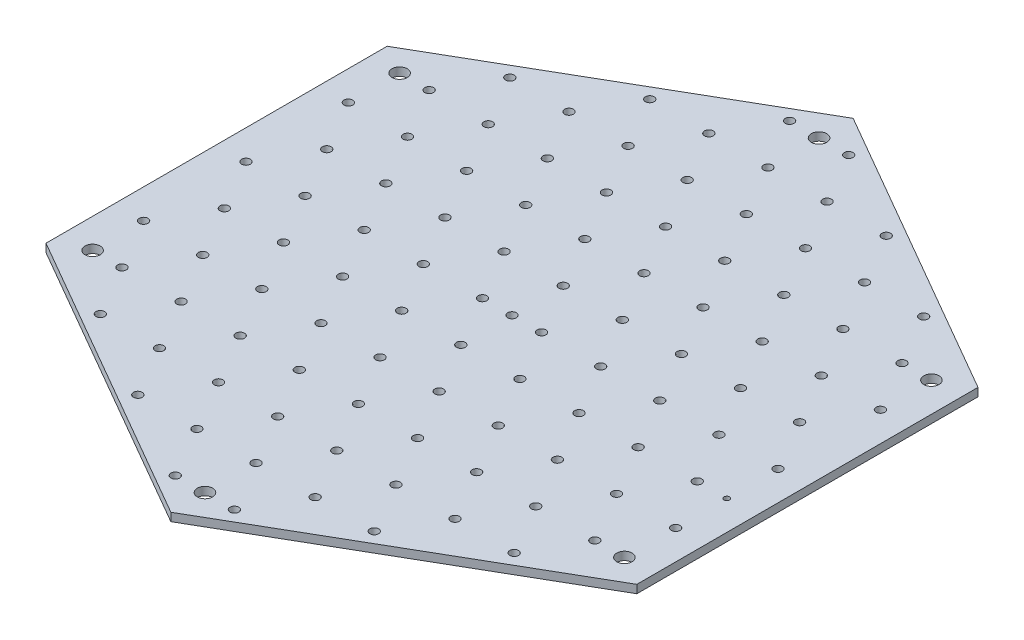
from build123d import *

# Parameters (mm, degrees)
BOSS_EXTRUDE1_DEPTH  = 1.5
SKETCH4_R            = 1.4
CUT_EXTRUDE3_DEPTH   = 83.693334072
LPATTERN4_COUNT      = 6
LPATTERN4_PITCH      = 10.83
LPATTERN4_COL_COUNT  = 5
LPATTERN4_COL_PITCH  = 10.83
LPATTERN5_COUNT      = 6
LPATTERN5_PITCH      = 10.83
LPATTERN5_COL_COUNT  = 5
LPATTERN5_COL_PITCH  = 10.83
LPATTERN6_COUNT      = 7
LPATTERN6_PITCH      = 10.83
LPATTERN6_COL_COUNT  = 4
LPATTERN6_COL_PITCH  = 10.83
LPATTERN7_COUNT      = 7
LPATTERN7_PITCH      = 10.83
LPATTERN7_COL_COUNT  = 3
LPATTERN7_COL_PITCH  = 10.83
LPATTERN8_COUNT      = 6
LPATTERN8_PITCH      = 10.83
LPATTERN9_COUNT      = 6
LPATTERN9_PITCH      = 10.83
LPATTERN10_COUNT     = 7
LPATTERN10_PITCH     = 10.83
LPATTERN10_COL_COUNT = 3
LPATTERN10_COL_PITCH = 10.83
LPATTERN11_COUNT     = 7
LPATTERN11_PITCH     = 10.83
LPATTERN11_COL_COUNT = 4
LPATTERN11_COL_PITCH = 10.83
LPATTERN12_COUNT     = 5
LPATTERN12_PITCH     = 10.83
LPATTERN12_COL_COUNT = 6
LPATTERN12_COL_PITCH = 10.83
LPATTERN13_COUNT     = 5
LPATTERN13_PITCH     = 10.83
LPATTERN13_COL_COUNT = 6
LPATTERN13_COL_PITCH = 10.83
LPATTERN14_COUNT     = 5
LPATTERN14_PITCH     = 10.83
LPATTERN15_COUNT     = 4
LPATTERN15_PITCH     = 10.83
LPATTERN16_COUNT     = 3
LPATTERN16_PITCH     = 10.83
LPATTERN17_COUNT     = 5
LPATTERN17_PITCH     = 10.83
LPATTERN18_COUNT     = 4
LPATTERN18_PITCH     = 10.83
LPATTERN19_COUNT     = 3
LPATTERN19_PITCH     = 10.83
SKETCH16_R           = 0.5
CUT_EXTRUDE4_DEPTH   = 83.693334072


with BuildPart() as part:
    # Sketch1 → Boss-Extrude1 (new body)
    with BuildSketch(Plane(origin=(0, 0, 0), x_dir=(1, 0, 0), z_dir=(0, 1, 0))):
        Polygon((0, 62.5), (-54.126587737, 31.25), (-54.126587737, -31.25), (0, -62.5), (54.126587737, -31.25), (54.126587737, 31.25), align=None)
    extrude(amount=BOSS_EXTRUDE1_DEPTH)

    # Sketch4 → Cut-Extrude3 (cut, through all)
    with BuildSketch(Plane(origin=(0, 1.5, 0), x_dir=(1, 0, 0), z_dir=(0, 1, 0))):
        with Locations(Location((0, 56.253070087, 0), (0, 0, 270))):
            Circle(SKETCH4_R)
        with Locations(Location((-48.713928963, 28.125, 0), (0, 0, 270))):
            Circle(SKETCH4_R)
        with Locations(Location((-48.716587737, -28.126535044, 0), (0, 0, 270))):
            Circle(SKETCH4_R)
        with Locations(Location((0, -56.253070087, 0), (0, 0, 270))):
            Circle(SKETCH4_R)
        with Locations(Location((48.716587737, -28.126535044, 0), (0, 0, 270))):
            Circle(SKETCH4_R)
        with Locations(Location((48.716587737, 28.126535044, 0), (0, 0, 270))):
            Circle(SKETCH4_R)
    extrude(amount=-CUT_EXTRUDE3_DEPTH, mode=Mode.SUBTRACT)

    # Sketch5 → Cut-Revolve1 (revolve, cut)
    with BuildSketch(Plane.XY, mode=Mode.PRIVATE) as cut_revolve1_sk:
        Polygon((0, 1.5), (-0.8, 1.5), (-0.675, 0), (0, 0), align=None)
    revolve(cut_revolve1_sk.sketch.rotate(Axis((0, -0.75, 0), (0, 1, 0)), 270), axis=Axis((0, -0.75, 0), (0, 1, 0)), mode=Mode.SUBTRACT)

    # Sketch6 → Cut-Revolve2 (revolve, cut)
    with BuildSketch(Plane.XY, mode=Mode.PRIVATE) as cut_revolve2_sk:
        Polygon((5.415, 1.5), (4.615, 1.5), (4.74, 0), (5.415, 0), align=None)
    cut_revolve2 = revolve(cut_revolve2_sk.sketch.rotate(Axis((5.415, -0.75, 0), (0, 1, 0)), 270), axis=Axis((5.415, -0.75, 0), (0, 1, 0)), mode=Mode.SUBTRACT)

    # Sketch7 → Cut-Revolve3 (revolve, cut)
    with BuildSketch(Plane.XY, mode=Mode.PRIVATE) as cut_revolve3_sk:
        Polygon((16.245, 1.5), (15.445, 1.5), (15.57, 0), (16.245, 0), align=None)
    cut_revolve3 = revolve(cut_revolve3_sk.sketch.rotate(Axis((16.245, -0.75, 0), (0, 1, 0)), 270), axis=Axis((16.245, -0.75, 0), (0, 1, 0)), mode=Mode.SUBTRACT)

    # Sketch8 → Cut-Revolve4 (revolve, cut)
    with BuildSketch(Plane.XY, mode=Mode.PRIVATE) as cut_revolve4_sk:
        Polygon((27.075, 1.5), (26.275, 1.5), (26.4, 0), (27.075, 0), align=None)
    cut_revolve4 = revolve(cut_revolve4_sk.sketch.rotate(Axis((27.075, -0.75, 0), (0, 1, 0)), 270), axis=Axis((27.075, -0.75, 0), (0, 1, 0)), mode=Mode.SUBTRACT)

    # Sketch9 → Cut-Revolve5 (revolve, cut)
    with BuildSketch(Plane.XY, mode=Mode.PRIVATE) as cut_revolve5_sk:
        Polygon((37.905, 1.5), (37.105, 1.5), (37.23, 0), (37.905, 0), align=None)
    cut_revolve5 = revolve(cut_revolve5_sk.sketch.rotate(Axis((37.905, -0.75, 0), (0, 1, 0)), 270), axis=Axis((37.905, -0.75, 0), (0, 1, 0)), mode=Mode.SUBTRACT)

    # Sketch10 → Cut-Revolve6 (revolve, cut)
    with BuildSketch(Plane.XY, mode=Mode.PRIVATE) as cut_revolve6_sk:
        Polygon((48.735, 1.5), (47.935, 1.5), (48.06, 0), (48.735, 0), align=None)
    cut_revolve6 = revolve(cut_revolve6_sk.sketch.rotate(Axis((48.735, -0.75, 0), (0, 1, 0)), 270), axis=Axis((48.735, -0.75, 0), (0, 1, 0)), mode=Mode.SUBTRACT)

    # Sketch11 → Cut-Revolve7 (revolve, cut)
    with BuildSketch(Plane.XY, mode=Mode.PRIVATE) as cut_revolve7_sk:
        Polygon((-48.735, 1.5), (-49.535, 1.5), (-49.41, 0), (-48.735, 0), align=None)
    cut_revolve7 = revolve(cut_revolve7_sk.sketch.rotate(Axis((-48.735, -0.75, 0), (0, 1, 0)), 270), axis=Axis((-48.735, -0.75, 0), (0, 1, 0)), mode=Mode.SUBTRACT)

    # Sketch12 → Cut-Revolve8 (revolve, cut)
    with BuildSketch(Plane.XY, mode=Mode.PRIVATE) as cut_revolve8_sk:
        Polygon((-37.905, 1.5), (-38.705, 1.5), (-38.58, 0), (-37.905, 0), align=None)
    cut_revolve8 = revolve(cut_revolve8_sk.sketch.rotate(Axis((-37.905, -0.75, 0), (0, 1, 0)), 270), axis=Axis((-37.905, -0.75, 0), (0, 1, 0)), mode=Mode.SUBTRACT)

    # Sketch13 → Cut-Revolve9 (revolve, cut)
    with BuildSketch(Plane.XY, mode=Mode.PRIVATE) as cut_revolve9_sk:
        Polygon((-27.075, 1.5), (-27.875, 1.5), (-27.75, 0), (-27.075, 0), align=None)
    cut_revolve9 = revolve(cut_revolve9_sk.sketch.rotate(Axis((-27.075, -0.75, 0), (0, 1, 0)), 270), axis=Axis((-27.075, -0.75, 0), (0, 1, 0)), mode=Mode.SUBTRACT)

    # Sketch14 → Cut-Revolve10 (revolve, cut)
    with BuildSketch(Plane.XY, mode=Mode.PRIVATE) as cut_revolve10_sk:
        Polygon((-16.245, 1.5), (-17.045, 1.5), (-16.92, 0), (-16.245, 0), align=None)
    cut_revolve10 = revolve(cut_revolve10_sk.sketch.rotate(Axis((-16.245, -0.75, 0), (0, 1, 0)), 270), axis=Axis((-16.245, -0.75, 0), (0, 1, 0)), mode=Mode.SUBTRACT)

    # Sketch15 → Cut-Revolve11 (revolve, cut)
    with BuildSketch(Plane.XY, mode=Mode.PRIVATE) as cut_revolve11_sk:
        Polygon((-5.415, 1.5), (-6.215, 1.5), (-6.09, 0), (-5.415, 0), align=None)
    cut_revolve11 = revolve(cut_revolve11_sk.sketch.rotate(Axis((-5.415, -0.75, 0), (0, 1, 0)), 270), axis=Axis((-5.415, -0.75, 0), (0, 1, 0)), mode=Mode.SUBTRACT)

    # LPattern4: Cut-Revolve2 ×6
    with Locations(*[Vector(-0.49999999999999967, 0, 0.8660254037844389) * (i * LPATTERN4_PITCH) for i in range(1, LPATTERN4_COUNT)]):
        add(cut_revolve2, mode=Mode.SUBTRACT)

    # LPattern4 col: Cut-Revolve2 ×5
    with Locations(*[Vector(0.49999999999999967, 0, -0.8660254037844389) * (i * LPATTERN4_COL_PITCH) for i in range(1, LPATTERN4_COL_COUNT)]):
        add(cut_revolve2, mode=Mode.SUBTRACT)

    # LPattern5: Cut-Revolve3 ×6
    with Locations(*[Vector(-0.49999999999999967, 0, 0.8660254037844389) * (i * LPATTERN5_PITCH) for i in range(1, LPATTERN5_COUNT)]):
        add(cut_revolve3, mode=Mode.SUBTRACT)

    # LPattern5 col: Cut-Revolve3 ×5
    with Locations(*[Vector(0.49999999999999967, 0, -0.8660254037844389) * (i * LPATTERN5_COL_PITCH) for i in range(1, LPATTERN5_COL_COUNT)]):
        add(cut_revolve3, mode=Mode.SUBTRACT)

    # LPattern6: Cut-Revolve4 ×7
    with Locations(*[Vector(-0.49999999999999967, 0, 0.8660254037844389) * (i * LPATTERN6_PITCH) for i in range(1, LPATTERN6_COUNT)]):
        add(cut_revolve4, mode=Mode.SUBTRACT)

    # LPattern6 col: Cut-Revolve4 ×4
    with Locations(*[Vector(0.49999999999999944, 0, -0.866025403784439) * (i * LPATTERN6_COL_PITCH) for i in range(1, LPATTERN6_COL_COUNT)]):
        add(cut_revolve4, mode=Mode.SUBTRACT)

    # LPattern7: Cut-Revolve5 ×7
    with Locations(*[Vector(-0.49999999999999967, 0, 0.8660254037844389) * (i * LPATTERN7_PITCH) for i in range(1, LPATTERN7_COUNT)]):
        add(cut_revolve5, mode=Mode.SUBTRACT)

    # LPattern7 col: Cut-Revolve5 ×3
    with Locations(*[Vector(0.49999999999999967, 0, -0.8660254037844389) * (i * LPATTERN7_COL_PITCH) for i in range(1, LPATTERN7_COL_COUNT)]):
        add(cut_revolve5, mode=Mode.SUBTRACT)

    # LPattern8: Cut-Revolve6 ×6
    with Locations(*[Vector(-0.49999999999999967, 0, 0.8660254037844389) * (i * LPATTERN8_PITCH) for i in range(1, LPATTERN8_COUNT)]):
        add(cut_revolve6, mode=Mode.SUBTRACT)

    # LPattern9: Cut-Revolve7 ×6
    with Locations(*[Vector(0.49999999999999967, 0, -0.8660254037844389) * (i * LPATTERN9_PITCH) for i in range(1, LPATTERN9_COUNT)]):
        add(cut_revolve7, mode=Mode.SUBTRACT)

    # LPattern10: Cut-Revolve8 ×7
    with Locations(*[Vector(0.49999999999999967, 0, -0.8660254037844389) * (i * LPATTERN10_PITCH) for i in range(1, LPATTERN10_COUNT)]):
        add(cut_revolve8, mode=Mode.SUBTRACT)

    # LPattern10 col: Cut-Revolve8 ×3
    with Locations(*[Vector(-0.49999999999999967, 0, 0.8660254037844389) * (i * LPATTERN10_COL_PITCH) for i in range(1, LPATTERN10_COL_COUNT)]):
        add(cut_revolve8, mode=Mode.SUBTRACT)

    # LPattern11: Cut-Revolve9 ×7
    with Locations(*[Vector(0.49999999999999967, 0, -0.8660254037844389) * (i * LPATTERN11_PITCH) for i in range(1, LPATTERN11_COUNT)]):
        add(cut_revolve9, mode=Mode.SUBTRACT)

    # LPattern11 col: Cut-Revolve9 ×4
    with Locations(*[Vector(-0.49999999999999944, 0, 0.866025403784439) * (i * LPATTERN11_COL_PITCH) for i in range(1, LPATTERN11_COL_COUNT)]):
        add(cut_revolve9, mode=Mode.SUBTRACT)

    # LPattern12: Cut-Revolve10 ×5
    with Locations(*[Vector(-0.49999999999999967, 0, 0.8660254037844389) * (i * LPATTERN12_PITCH) for i in range(1, LPATTERN12_COUNT)]):
        add(cut_revolve10, mode=Mode.SUBTRACT)

    # LPattern12 col: Cut-Revolve10 ×6
    with Locations(*[Vector(0.49999999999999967, 0, -0.8660254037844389) * (i * LPATTERN12_COL_PITCH) for i in range(1, LPATTERN12_COL_COUNT)]):
        add(cut_revolve10, mode=Mode.SUBTRACT)

    # LPattern13: Cut-Revolve11 ×5
    with Locations(*[Vector(-0.49999999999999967, 0, 0.8660254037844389) * (i * LPATTERN13_PITCH) for i in range(1, LPATTERN13_COUNT)]):
        add(cut_revolve11, mode=Mode.SUBTRACT)

    # LPattern13 col: Cut-Revolve11 ×6
    with Locations(*[Vector(0.49999999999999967, 0, -0.8660254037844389) * (i * LPATTERN13_COL_PITCH) for i in range(1, LPATTERN13_COL_COUNT)]):
        add(cut_revolve11, mode=Mode.SUBTRACT)

    # LPattern14: Cut-Revolve3 ×5
    with Locations(*[Vector(0.49999999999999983, 0, 0.8660254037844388) * (i * LPATTERN14_PITCH) for i in range(1, LPATTERN14_COUNT)]):
        add(cut_revolve3, mode=Mode.SUBTRACT)

    # LPattern15: Cut-Revolve4 ×4
    with Locations(*[Vector(0.4999999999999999, 0, 0.8660254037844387) * (i * LPATTERN15_PITCH) for i in range(1, LPATTERN15_COUNT)]):
        add(cut_revolve4, mode=Mode.SUBTRACT)

    # LPattern16: Cut-Revolve5 ×3
    with Locations(*[Vector(0.49999999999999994, 0, 0.8660254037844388) * (i * LPATTERN16_PITCH) for i in range(1, LPATTERN16_COUNT)]):
        add(cut_revolve5, mode=Mode.SUBTRACT)

    # LPattern17: Cut-Revolve10 ×5
    with Locations(*[Vector(-0.4999999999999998, 0, -0.8660254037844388) * (i * LPATTERN17_PITCH) for i in range(1, LPATTERN17_COUNT)]):
        add(cut_revolve10, mode=Mode.SUBTRACT)

    # LPattern18: Cut-Revolve9 ×4
    with Locations(*[Vector(-0.49999999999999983, 0, -0.8660254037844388) * (i * LPATTERN18_PITCH) for i in range(1, LPATTERN18_COUNT)]):
        add(cut_revolve9, mode=Mode.SUBTRACT)

    # LPattern19: Cut-Revolve8 ×3
    with Locations(*[Vector(-0.49999999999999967, 0, -0.8660254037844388) * (i * LPATTERN19_PITCH) for i in range(1, LPATTERN19_COUNT)]):
        add(cut_revolve8, mode=Mode.SUBTRACT)

    # Sketch16 → Cut-Extrude4 (cut, through all)
    with BuildSketch(Plane(origin=(0, 1.5, 0), x_dir=(1, 0, 0), z_dir=(0, 1, 0))):
        with Locations(Location((48.735, -9.379055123, 0), (0, 0, 270))):
            Circle(SKETCH16_R)
    extrude(amount=-CUT_EXTRUDE4_DEPTH, mode=Mode.SUBTRACT)


solid = part.part
